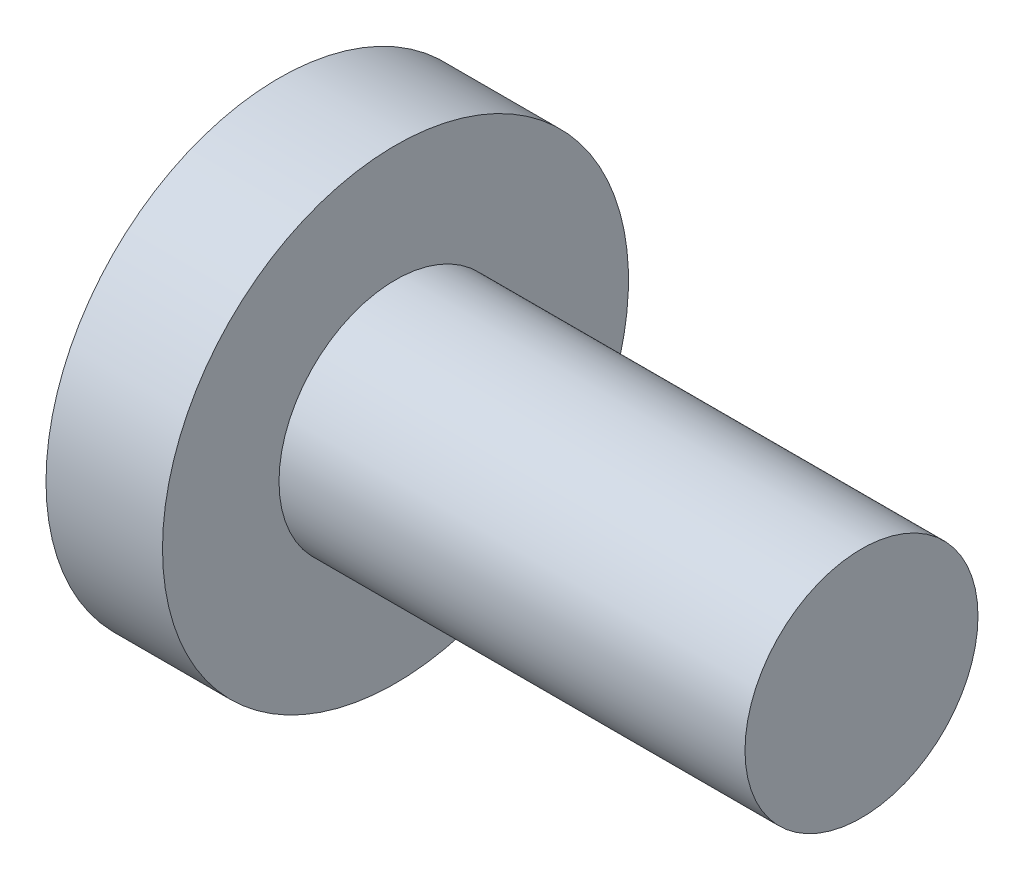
from build123d import *


with BuildPart() as part:
    # Skizze1 → Rotation1 (revolve)
    with BuildSketch(Plane.XY, mode=Mode.PRIVATE) as rotation1_sk:
        Polygon((0, 0), (0, 10), (5, 10), (5, 5), (25, 5), (25, 0), align=None)
    revolve(rotation1_sk.sketch.rotate(Axis((0, 0, 0), (1, 0, 0)), 90), axis=Axis((0, 0, 0), (1, 0, 0)))


solid = part.part
